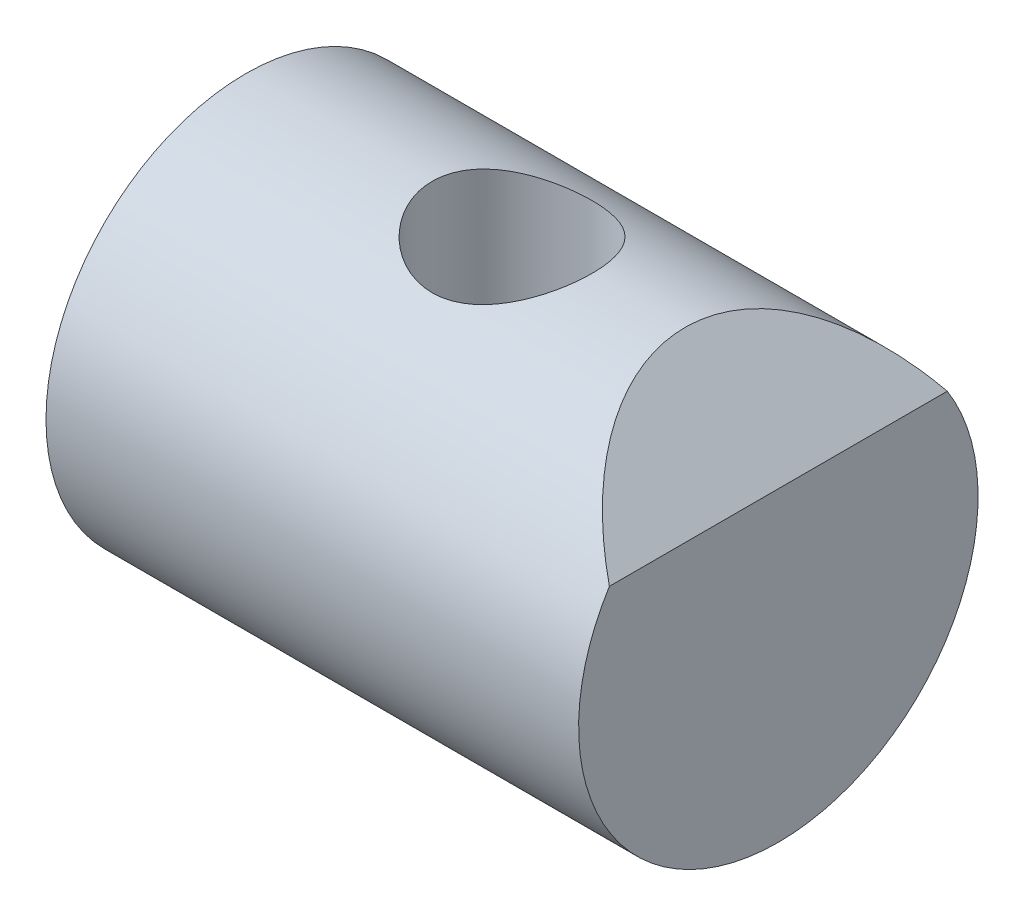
from build123d import *

# Parameters (mm, degrees)
ESQUISSE1_W             = 40
ESQUISSE1_H             = 30
BASE_EXTRUSION_DEPTH    = 30
TROU_TARAUD_M12X1_751_D = 12
ENL_V_MAT_EXTRU_1_DEPTH = 40.05124838
ESQUISSE5_OUTSIDE_W     = 43.662
ESQUISSE5_OUTSIDE_H     = 43.662
ESQUISSE5_OUTSIDE_R     = 15
ENL_V_MAT_EXTRU_2_DEPTH = 53.201532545


with BuildPart() as part:
    # Esquisse1 → Base-Extrusion (new body)
    with BuildSketch(Plane.XY):
        Rectangle(ESQUISSE1_W, ESQUISSE1_H)
    extrude(amount=BASE_EXTRUSION_DEPTH)

    # Trou taraud_ M12x1.751 (through all)
    with Locations(Plane(origin=(0, 15, 0), x_dir=(-1, 0, 0), z_dir=(0, 1, 0))):
        with Locations((0, 15)):
            Hole(TROU_TARAUD_M12X1_751_D / 2)

    # Esquisse4 → Enl_v. mat.-Extru.1 (cut, through all)
    with BuildSketch(Plane.XY.offset(30)):
        Polygon((13, 15), (20, 15), (20, 8), align=None)
    extrude(amount=-ENL_V_MAT_EXTRU_1_DEPTH, mode=Mode.SUBTRACT)

    # Esquisse5 outside → Enl_v. mat.-Extru.2 (cut, through all)
    with BuildSketch(Plane.ZY.offset(20)):
        with Locations((15, 0)):
            Rectangle(ESQUISSE5_OUTSIDE_W, ESQUISSE5_OUTSIDE_H)
        with Locations(Location((15, 0, 0), (0, 0, 270))):
            Circle(ESQUISSE5_OUTSIDE_R, mode=Mode.SUBTRACT)
    extrude(amount=-ENL_V_MAT_EXTRU_2_DEPTH, mode=Mode.SUBTRACT)


solid = part.part
